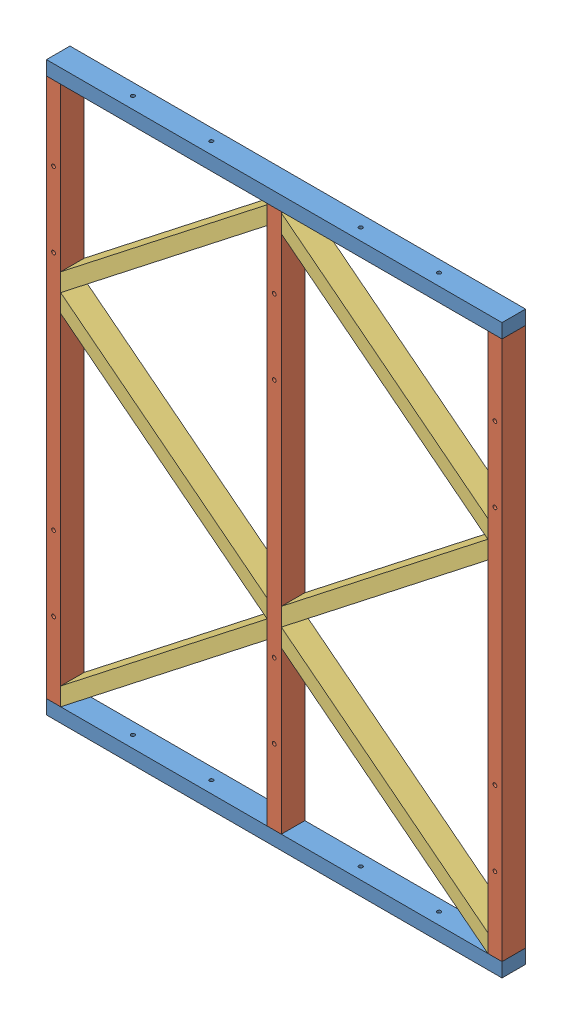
SolidWorks assembly #02 Side Piece.SLDASM, configuration Default (file format 15000). Lengths in mm.
Overall size (1220 1520 63).
11 component instances, 3 part files, 25 mates.
Components (placement in the parent):
- A - 4ft CLS-1: A - 4ft CLS.SLDPRT [Default] at (-292.9005 499.6588 1116.8793) size (1220 38 63)
- B - 5ft CLS vertical-1: B - 5ft CLS vertical.SLDPRT [Default] at (-292.9005 537.6588 1116.8793) x (0 0 -1) z (1 0 0) size (63 1444 38)
- A - 4ft CLS-2: A - 4ft CLS.SLDPRT [Default] at (-292.9005 1981.6588 1116.8793) size (1220 38 63)
- B - 5ft CLS vertical-2: B - 5ft CLS vertical.SLDPRT [Default] at (298.0995 537.6588 1116.8793) x (0 0 -1) z (1 0 0) size (63 1444 38)
- B - 5ft CLS vertical-3: B - 5ft CLS vertical.SLDPRT [Default] at (889.0995 537.6588 1116.8793) x (0 0 -1) z (1 0 0) size (63 1444 38)
- C - angled brace-1: C - angled brace.SLDPRT [Default] at (-254.9005 537.6588 1053.8793) size (553 480.27 63)
- C - angled brace-2: C - angled brace.SLDPRT [Default] at (-254.9005 1498.206 1116.8793) x (1 0 0) z (0 0 -1) size (553 480.27 63)
- C - angled brace-3: C - angled brace.SLDPRT [Default] at (-254.9005 1498.206 1053.8793) size (553 480.27 63)
- C - angled brace-5: C - angled brace.SLDPRT [Default] at (889.0995 1498.206 1116.8793) x (-1 0 0) z (0 0 -1) size (553 480.27 63)
- C - angled brace-6: C - angled brace.SLDPRT [Default] at (889.0995 1498.206 1053.8793) x (-1 0 0) z (0 0 1) size (553 480.27 63)
- C - angled brace-7: C - angled brace.SLDPRT [Default] at (889.0995 537.6588 1116.8793) x (-1 0 0) z (0 0 -1) size (553 480.27 63)
Mates (geometry in assembly coordinates):
- Coincident1: coincident anti-aligned: plane of A - 4ft CLS-1 through (-292.9005 537.6588 1116.8793) normal (0 1 0); plane of B - 5ft -2xCLS vertical-1 through (-254.9005 537.6588 1116.8793) normal (0 -1 0)
- Coincident2: coincident aligned: plane of A - 4ft CLS-1 through (-292.9005 537.6588 1116.8793) normal (-1 0 0); plane of B - 5ft -2xCLS vertical-1 through (-292.9005 537.6588 1116.8793) normal (-1 0 0)
- Coincident3: coincident aligned: plane of A - 4ft CLS-1 through (-292.9005 537.6588 1116.8793) normal (0 0 1); plane of B - 5ft -2xCLS vertical-1 through (-254.9005 537.6588 1116.8793) normal (0 0 1)
- Coincident4: coincident anti-aligned: plane of B - 5ft -2xCLS vertical-1 through (-254.9005 1981.6588 1116.8793) normal (0 1 0); plane of A - 4ft CLS-2 through (-292.9005 1981.6588 1116.8793) normal (0 -1 0)
- Coincident5: coincident aligned: plane of B - 5ft -2xCLS vertical-1 through (-254.9005 537.6588 1116.8793) normal (0 0 1); plane of A - 4ft CLS-2 through (-292.9005 2019.6588 1116.8793) normal (0 0 1)
- Coincident6: coincident aligned: plane of B - 5ft -2xCLS vertical-1 through (-292.9005 537.6588 1116.8793) normal (-1 0 0); plane of A - 4ft CLS-2 through (-292.9005 2019.6588 1116.8793) normal (-1 0 0)
- Coincident7: coincident anti-aligned: plane of A - 4ft CLS-1 through (-292.9005 537.6588 1116.8793) normal (0 1 0); plane of B - 5ft CLS vertical-2 through (336.0995 537.6588 1116.8793) normal (0 -1 0)
- Coincident8: coincident aligned: plane of A - 4ft CLS-1 through (-292.9005 537.6588 1116.8793) normal (0 0 1); plane of B - 5ft CLS vertical-2 through (336.0995 537.6588 1116.8793) normal (0 0 1)
- Coincident9: coincident anti-aligned: plane of A - 4ft CLS-2 through (-292.9005 1981.6588 1116.8793) normal (0 -1 0); plane of B - 5ft CLS vertical-2 through (336.0995 1981.6588 1116.8793) normal (0 1 0)
- Coincident10: coincident aligned: plane of A - 4ft CLS-2 through (-292.9005 2019.6588 1116.8793) normal (0 0 1); plane of B - 5ft CLS vertical-2 through (336.0995 537.6588 1116.8793) normal (0 0 1)
- Coincident11: coincident anti-aligned: plane of A - 4ft CLS-1 through (-292.9005 537.6588 1116.8793) normal (0 1 0); plane of B - 5ft CLS vertical-3 through (927.0995 537.6588 1116.8793) normal (0 -1 0)
- Coincident12: coincident aligned: plane of A - 4ft CLS-1 through (-292.9005 537.6588 1116.8793) normal (0 0 1); plane of B - 5ft CLS vertical-3 through (927.0995 537.6588 1116.8793) normal (0 0 1)
- Coincident13: coincident anti-aligned: plane of A - 4ft CLS-2 through (-292.9005 1981.6588 1116.8793) normal (0 -1 0); plane of B - 5ft CLS vertical-3 through (927.0995 1981.6588 1116.8793) normal (0 1 0)
- Coincident14: coincident aligned: plane of A - 4ft CLS-2 through (-292.9005 2019.6588 1116.8793) normal (0 0 1); plane of B - 5ft CLS vertical-3 through (927.0995 537.6588 1116.8793) normal (0 0 1)
- Coincident19: coincident aligned: plane of A - 4ft CLS-1 through (927.0995 537.6588 1116.8793) normal (1 0 0); plane of B - 5ft CLS vertical-3 through (927.0995 537.6588 1116.8793) normal (1 0 0)
- Coincident21: coincident: point of B - 5ft CLS vertical-2; point of assembly
- Coincident22: coincident anti-aligned: plane of B - 5ft -2xCLS vertical-1 through (-254.9005 537.6588 1116.8793) normal (1 0 0); plane of C - angled brace-1 through (-254.9005 537.6588 1116.8793) normal (-1 0 0)
- Coincident23: coincident aligned: plane of A - 4ft CLS-1 through (-292.9005 537.6588 1116.8793) normal (0 0 1); plane of C - angled brace-1 through (-254.9005 537.6588 1116.8793) normal (0 0 1)
- Coincident24: coincident anti-aligned: plane of B - 5ft -2xCLS vertical-1 through (-254.9005 537.6588 1116.8793) normal (1 0 0); plane of C - angled brace-2 through (-254.9005 1498.206 1053.8793) normal (-1 0 0)
- Coincident25: coincident aligned: plane of A - 4ft CLS-1 through (-292.9005 537.6588 1053.8793) normal (0 0 -1); plane of C - angled brace-2 through (-254.9005 1498.206 1053.8793) normal (0 0 -1)
- Coincident29: coincident anti-aligned: plane of B - 5ft -2xCLS vertical-1 through (-254.9005 537.6588 1116.8793) normal (1 0 0); plane of C - angled brace-3 through (-254.9005 1498.206 1116.8793) normal (-1 0 0)
- Coincident30: coincident aligned: plane of A - 4ft CLS-1 through (-292.9005 537.6588 1116.8793) normal (0 0 1); plane of C - angled brace-3 through (-254.9005 1498.206 1116.8793) normal (0 0 1)
- Coincident33: coincident aligned: line of B - 5ft -2xCLS vertical-1 through (-254.9005 537.6588 1116.8793) axis (0 0 -1); line of C - angled brace-1 through (-254.9005 537.6588 1116.8793) axis (0 0 -1)
- Coincident34: coincident anti-aligned: line of C - angled brace-1 through (298.0995 1017.9324 1116.8793) axis (0 0 -1); line of C - angled brace-2 through (298.0995 1017.9324 1053.8793) axis (0 0 1)
- Coincident35: coincident anti-aligned: line of C - angled brace-2 through (-254.9005 1498.206 1053.8793) axis (0 0 1); line of C - angled brace-3 through (-254.9005 1498.206 1116.8793) axis (0 0 -1)
